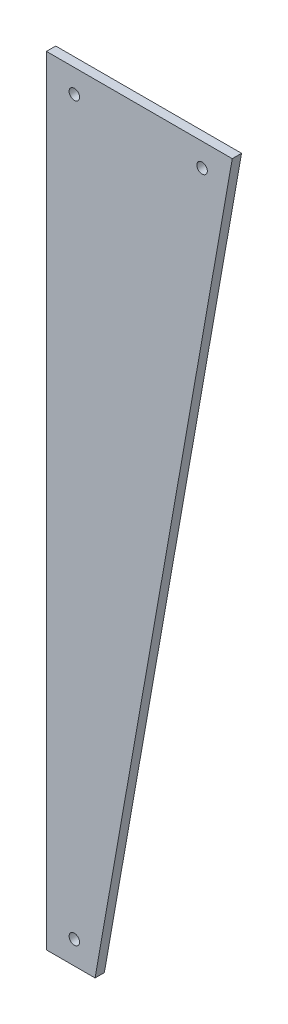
from build123d import *

# Parameters (mm, degrees)
SKETCH1_R           = 2.25
BOSS_EXTRUDE1_DEPTH = 4


with BuildPart() as part:
    # Sketch1 → Boss-Extrude1 (new body)
    with BuildSketch(Plane.XY):
        Polygon((80, 0), (20.930461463, -335), (0, -335), (0, 0), align=None)
        with Locations((12, -325)):
            Circle(SKETCH1_R, mode=Mode.SUBTRACT)
        with Locations((67, -10)):
            Circle(SKETCH1_R, mode=Mode.SUBTRACT)
        with Locations((12, -10)):
            Circle(SKETCH1_R, mode=Mode.SUBTRACT)
    extrude(amount=BOSS_EXTRUDE1_DEPTH)


solid = part.part
